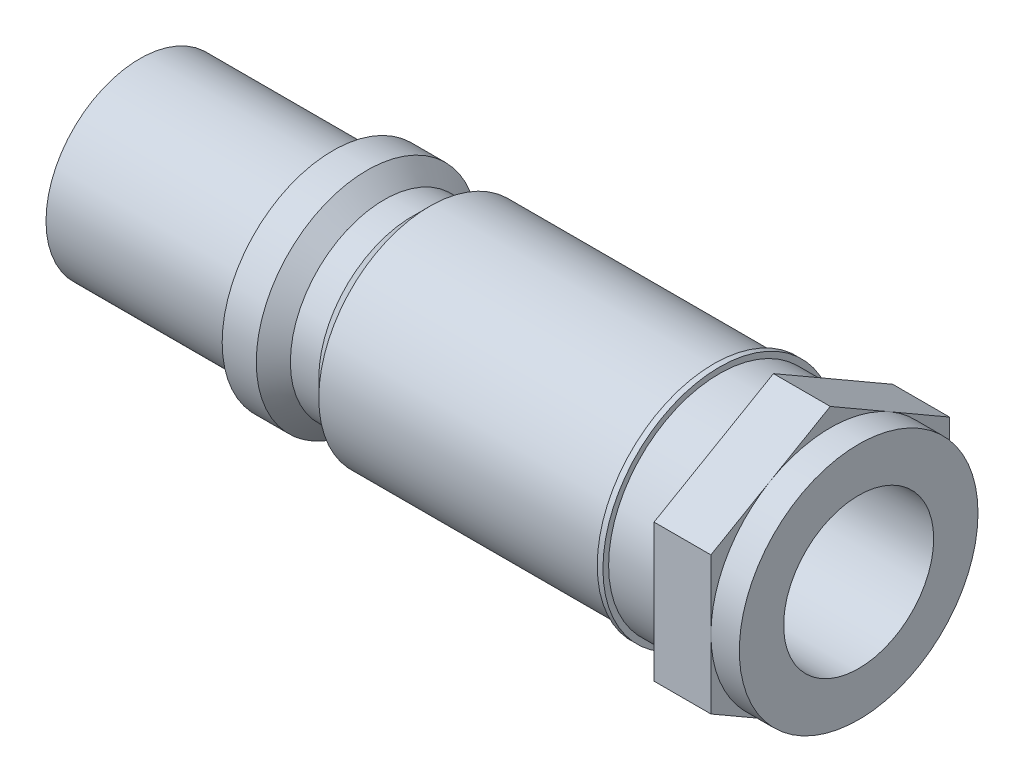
from build123d import *

# Parameters (mm, degrees)
SALIENTE_EXTRUIR2_DEPTH = 10
CROQUIS5_R              = 21
SALIENTE_EXTRUIR3_DEPTH = 5
CROQUIS6_R              = 13.2
CORTAR_EXTRUIR2_DEPTH   = 131.503831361


with BuildPart() as part:
    # Croquis1 → Revoluci_n1 (revolve)
    with BuildSketch(Plane.XY, mode=Mode.PRIVATE) as revoluci_n1_sk:
        Polygon((0, 0), (0, 16.5), (34, 16.5), (34, 19.5), (40, 19.5), (43, 16.5), (48, 16.5), (51, 19.5), (101, 19.5), (101, 20.5), (102, 20.5), (102, 19.5), (111.5, 19.5), (111.5, 0), align=None)
    revolve(revoluci_n1_sk.sketch.rotate(Axis((0, 0, 0), (1, 0, 0)), 90), axis=Axis((0, 0, 0), (1, 0, 0)))

    # Croquis4 → Saliente-Extruir2 (add)
    with BuildSketch(Plane(origin=(111.5, 0, 0), x_dir=(0, 0, -1), z_dir=(1, 0, 0))):
        Polygon((0, 24.248711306), (-21, 12.124355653), (-21, -12.124355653), (0, -24.248711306), (21, -12.124355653), (21, 12.124355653), align=None)
    extrude(amount=SALIENTE_EXTRUIR2_DEPTH)

    # Croquis5 → Saliente-Extruir3 (add)
    with BuildSketch(Plane(origin=(121.5, 0, 0), x_dir=(0, 0, -1), z_dir=(1, 0, 0))):
        Circle(CROQUIS5_R)
    extrude(amount=SALIENTE_EXTRUIR3_DEPTH)

    # Croquis6 → Cortar-Extruir2 (cut, through all)
    with BuildSketch(Plane(origin=(126.5, 0, 0), x_dir=(0, 0, -1), z_dir=(1, 0, 0))):
        Circle(CROQUIS6_R)
    extrude(amount=-CORTAR_EXTRUIR2_DEPTH, mode=Mode.SUBTRACT)


solid = part.part
